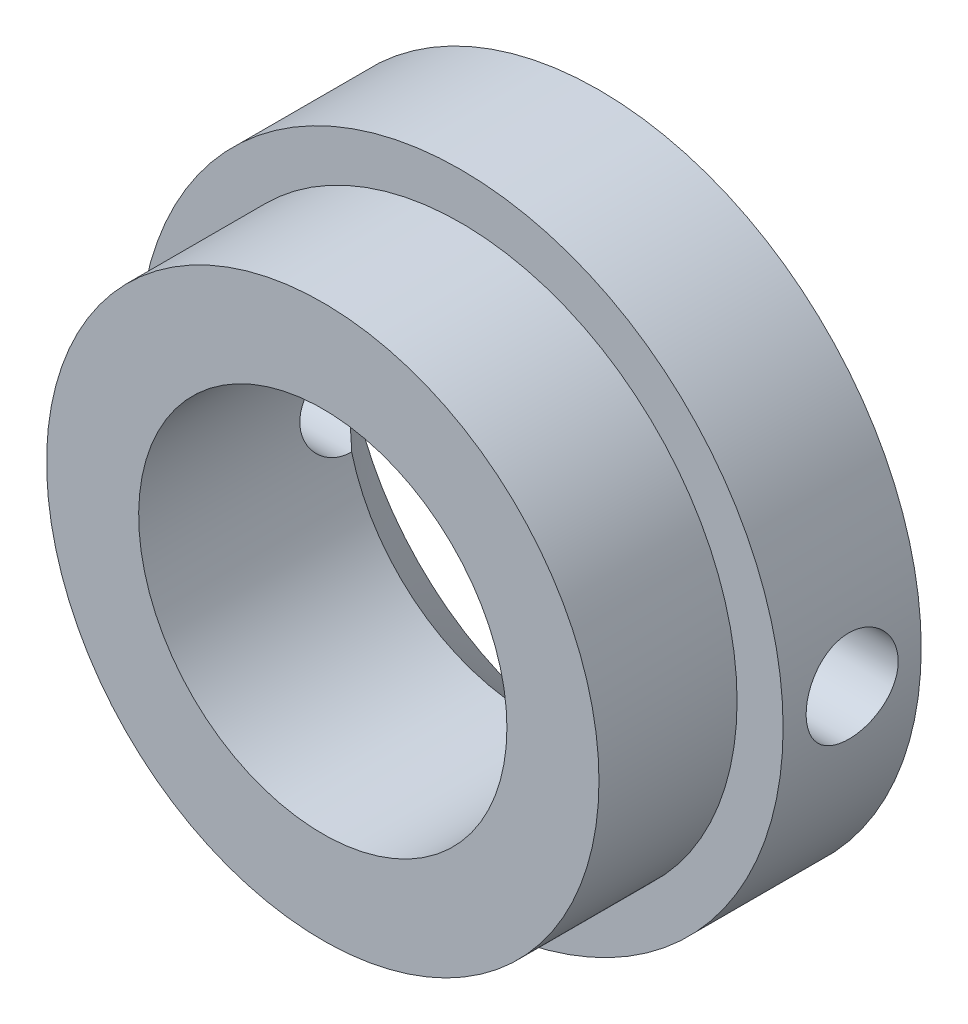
ISO-10303-21;
HEADER;
FILE_DESCRIPTION(('STEP AP214'),'2;1');
FILE_NAME('part.step','',(''),(''),'','','');
FILE_SCHEMA(('AUTOMOTIVE_DESIGN { 1 0 10303 214 1 1 1 1 }'));
ENDSEC;
DATA;
#1=APPLICATION_CONTEXT('core data for automotive mechanical design processes');
#2=APPLICATION_PROTOCOL_DEFINITION('international standard','automotive_design',2000,#1);
#3=PRODUCT_CONTEXT('',#1,'mechanical');
#4=PRODUCT('Part','Part','',(#3));
#5=PRODUCT_RELATED_PRODUCT_CATEGORY('part','',(#4));
#6=PRODUCT_DEFINITION_FORMATION('','',#4);
#7=PRODUCT_DEFINITION_CONTEXT('part definition',#1,'design');
#8=PRODUCT_DEFINITION('design','',#6,#7);
#9=PRODUCT_DEFINITION_SHAPE('','',#8);
#10=(LENGTH_UNIT() NAMED_UNIT(*) SI_UNIT(.MILLI.,.METRE.));
#11=(NAMED_UNIT(*) PLANE_ANGLE_UNIT() SI_UNIT($,.RADIAN.));
#12=(NAMED_UNIT(*) SI_UNIT($,.STERADIAN.) SOLID_ANGLE_UNIT());
#13=UNCERTAINTY_MEASURE_WITH_UNIT(LENGTH_MEASURE(1.E-05),#10,'distance_accuracy_value','');
#14=(GEOMETRIC_REPRESENTATION_CONTEXT(3) GLOBAL_UNCERTAINTY_ASSIGNED_CONTEXT((#13)) GLOBAL_UNIT_ASSIGNED_CONTEXT((#10,
#11,#12)) REPRESENTATION_CONTEXT('',''));
#15=CARTESIAN_POINT('',(0.,0.,0.));
#16=DIRECTION('',(0.,0.,1.));
#17=DIRECTION('',(1.,0.,0.));
#18=AXIS2_PLACEMENT_3D('',#15,#16,#17);
#19=CARTESIAN_POINT('',(0.,0.,0.));
#20=DIRECTION('',(0.,0.,1.));
#21=DIRECTION('',(1.,0.,0.));
#22=AXIS2_PLACEMENT_3D('',#19,#20,#21);
#23=PLANE('',#22);
#24=CARTESIAN_POINT('',(0.,0.,0.));
#25=DIRECTION('',(0.,0.,1.));
#26=DIRECTION('',(1.,0.,0.));
#27=AXIS2_PLACEMENT_3D('',#24,#25,#26);
#28=CIRCLE('',#27,7.);
#29=CARTESIAN_POINT('',(7.,0.,0.));
#30=VERTEX_POINT('',#29);
#31=EDGE_CURVE('E94',#30,#30,#28,.T.);
#32=ORIENTED_EDGE('',*,*,#31,.F.);
#33=EDGE_LOOP('',(#32));
#34=FACE_BOUND('',#33,.T.);
#35=CARTESIAN_POINT('',(0.,0.,0.));
#36=DIRECTION('',(0.,0.,-1.));
#37=DIRECTION('',(-1.,0.,0.));
#38=AXIS2_PLACEMENT_3D('',#35,#36,#37);
#39=CIRCLE('',#38,5.5);
#40=CARTESIAN_POINT('',(-5.5,0.,0.));
#41=VERTEX_POINT('',#40);
#42=EDGE_CURVE('E87',#41,#41,#39,.T.);
#43=ORIENTED_EDGE('',*,*,#42,.F.);
#44=EDGE_LOOP('',(#43));
#45=FACE_BOUND('',#44,.T.);
#46=ADVANCED_FACE('F34',(#34,#45),#23,.F.);
#47=CARTESIAN_POINT('',(0.,0.,3.));
#48=DIRECTION('',(0.,0.,-1.));
#49=DIRECTION('',(-1.,0.,0.));
#50=AXIS2_PLACEMENT_3D('',#47,#48,#49);
#51=CYLINDRICAL_SURFACE('',#50,7.);
#52=CARTESIAN_POINT('',(-7.,0.,0.500000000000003));
#53=CARTESIAN_POINT('',(-6.99999913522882,0.0558653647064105,0.500002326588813));
#54=CARTESIAN_POINT('',(-6.99932420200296,0.111763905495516,0.504697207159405));
#55=CARTESIAN_POINT('',(-6.99669670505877,0.22200066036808,0.523349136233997));
#56=CARTESIAN_POINT('',(-6.99474286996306,0.276337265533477,0.537315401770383));
#57=CARTESIAN_POINT('',(-6.98977730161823,0.381838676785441,0.574086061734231));
#58=CARTESIAN_POINT('',(-6.98676634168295,0.433005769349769,0.596883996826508));
#59=CARTESIAN_POINT('',(-6.98001989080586,0.530779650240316,0.650655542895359));
#60=CARTESIAN_POINT('',(-6.97628450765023,0.577387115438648,0.681627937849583));
#61=CARTESIAN_POINT('',(-6.96847539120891,0.66505865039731,0.751104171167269));
#62=CARTESIAN_POINT('',(-6.96439965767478,0.706085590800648,0.789654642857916));
#63=CARTESIAN_POINT('',(-6.95638499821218,0.781111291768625,0.873092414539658));
#64=CARTESIAN_POINT('',(-6.95244607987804,0.815109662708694,0.917980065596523));
#65=CARTESIAN_POINT('',(-6.94513156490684,0.875255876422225,1.01306511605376));
#66=CARTESIAN_POINT('',(-6.94175855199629,0.901368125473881,1.06328524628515));
#67=CARTESIAN_POINT('',(-6.93598482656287,0.944773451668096,1.16745453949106));
#68=CARTESIAN_POINT('',(-6.93358406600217,0.96206696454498,1.22140351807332));
#69=CARTESIAN_POINT('',(-6.93004619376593,0.987229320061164,1.33111000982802));
#70=CARTESIAN_POINT('',(-6.92890059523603,0.995161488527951,1.38685271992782));
#71=CARTESIAN_POINT('',(-6.92797693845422,1.00157210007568,1.4988889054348));
#72=CARTESIAN_POINT('',(-6.92819880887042,1.00005103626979,1.55518235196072));
#73=CARTESIAN_POINT('',(-6.9299772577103,0.987650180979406,1.66627654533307));
#74=CARTESIAN_POINT('',(-6.9315238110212,0.976840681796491,1.72108532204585));
#75=CARTESIAN_POINT('',(-6.93576171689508,0.946279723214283,1.82810308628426));
#76=CARTESIAN_POINT('',(-6.9384530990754,0.92652803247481,1.88031200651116));
#77=CARTESIAN_POINT('',(-6.94468857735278,0.878569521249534,1.98086327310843));
#78=CARTESIAN_POINT('',(-6.94823569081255,0.850332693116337,2.0291911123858));
#79=CARTESIAN_POINT('',(-6.95578073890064,0.786226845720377,2.1204492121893));
#80=CARTESIAN_POINT('',(-6.95977870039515,0.750357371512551,2.16337915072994));
#81=CARTESIAN_POINT('',(-6.9678193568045,0.671617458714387,2.24303040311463));
#82=CARTESIAN_POINT('',(-6.97186212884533,0.628686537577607,2.27969194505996));
#83=CARTESIAN_POINT('',(-6.97950317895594,0.537249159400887,2.34529850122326));
#84=CARTESIAN_POINT('',(-6.98310145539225,0.488742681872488,2.37424348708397));
#85=CARTESIAN_POINT('',(-6.98945135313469,0.387481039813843,2.42359743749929));
#86=CARTESIAN_POINT('',(-6.99220254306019,0.334723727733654,2.44400205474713));
#87=CARTESIAN_POINT('',(-6.99654459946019,0.226483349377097,2.47564546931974));
#88=CARTESIAN_POINT('',(-6.99813553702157,0.171000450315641,2.48688482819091));
#89=CARTESIAN_POINT('',(-6.99996847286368,0.0594000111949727,2.49979981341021));
#90=CARTESIAN_POINT('',(-7.00022206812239,0.00329216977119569,2.50155766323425));
#91=CARTESIAN_POINT('',(-6.9993832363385,-0.108417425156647,2.49567759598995));
#92=CARTESIAN_POINT('',(-6.99829084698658,-0.164019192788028,2.48803994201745));
#93=CARTESIAN_POINT('',(-6.99488996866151,-0.272891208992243,2.46365402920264));
#94=CARTESIAN_POINT('',(-6.99258679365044,-0.32617055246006,2.44694557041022));
#95=CARTESIAN_POINT('',(-6.98702187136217,-0.429171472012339,2.40493413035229));
#96=CARTESIAN_POINT('',(-6.98376008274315,-0.478892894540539,2.37963077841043));
#97=CARTESIAN_POINT('',(-6.97661188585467,-0.573729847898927,2.32095309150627));
#98=CARTESIAN_POINT('',(-6.97272147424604,-0.618812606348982,2.28752628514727));
#99=CARTESIAN_POINT('',(-6.96476223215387,-0.702757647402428,2.21362396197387));
#100=CARTESIAN_POINT('',(-6.96069339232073,-0.741619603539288,2.17314807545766));
#101=CARTESIAN_POINT('',(-6.95279940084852,-0.812316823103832,2.08593164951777));
#102=CARTESIAN_POINT('',(-6.94897630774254,-0.844097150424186,2.03914636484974));
#103=CARTESIAN_POINT('',(-6.94204235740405,-0.89934784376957,1.940853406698));
#104=CARTESIAN_POINT('',(-6.9389314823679,-0.922818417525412,1.88934585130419));
#105=CARTESIAN_POINT('',(-6.93378885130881,-0.960697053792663,1.78323834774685));
#106=CARTESIAN_POINT('',(-6.93175358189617,-0.975134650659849,1.72864912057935));
#107=CARTESIAN_POINT('',(-6.92898304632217,-0.994631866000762,1.6177897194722));
#108=CARTESIAN_POINT('',(-6.92824769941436,-0.999692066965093,1.56151965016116));
#109=CARTESIAN_POINT('',(-6.92816308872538,-1.00027795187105,1.44944308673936));
#110=CARTESIAN_POINT('',(-6.92880127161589,-0.995889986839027,1.39363703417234));
#111=CARTESIAN_POINT('',(-6.9313646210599,-0.977888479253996,1.28356493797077));
#112=CARTESIAN_POINT('',(-6.93328978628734,-0.96427494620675,1.22929889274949));
#113=CARTESIAN_POINT('',(-6.93820594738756,-0.928238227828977,1.12386736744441));
#114=CARTESIAN_POINT('',(-6.94119628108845,-0.905820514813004,1.07269998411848));
#115=CARTESIAN_POINT('',(-6.94790672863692,-0.852820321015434,0.974838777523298));
#116=CARTESIAN_POINT('',(-6.95162686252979,-0.822237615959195,0.928145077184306));
#117=CARTESIAN_POINT('',(-6.95941831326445,-0.753459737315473,0.840117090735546));
#118=CARTESIAN_POINT('',(-6.96349241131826,-0.715200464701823,0.798833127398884));
#119=CARTESIAN_POINT('',(-6.97150911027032,-0.632290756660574,0.723240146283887));
#120=CARTESIAN_POINT('',(-6.97545168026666,-0.587638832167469,0.688932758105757));
#121=CARTESIAN_POINT('',(-6.98278331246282,-0.492951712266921,0.62811621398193));
#122=CARTESIAN_POINT('',(-6.98616952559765,-0.442890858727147,0.601646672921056));
#123=CARTESIAN_POINT('',(-6.99197878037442,-0.339010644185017,0.557530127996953));
#124=CARTESIAN_POINT('',(-6.99440283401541,-0.28519530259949,0.53987384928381));
#125=CARTESIAN_POINT('',(-6.99745181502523,-0.192605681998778,0.517958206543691));
#126=CARTESIAN_POINT('',(-6.99840255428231,-0.154406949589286,0.511233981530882));
#127=CARTESIAN_POINT('',(-6.99967694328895,-0.0774774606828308,0.502254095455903));
#128=CARTESIAN_POINT('',(-7.00000059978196,-0.0387467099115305,0.499998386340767));
#129=CARTESIAN_POINT('',(-7.,0.,0.500000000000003));
#130=B_SPLINE_CURVE_WITH_KNOTS('',3,(#52,#53,#54,#55,#56,#57,#58,#59,#60,#61,#62,#63,#64,#65,
#66,#67,#68,#69,#70,#71,#72,#73,#74,#75,#76,#77,#78,#79,#80,#81,#82,#83,#84,#85,#86,#87,#88,#89,
#90,#91,#92,#93,#94,#95,#96,#97,#98,#99,#100,#101,#102,#103,#104,#105,#106,#107,#108,#109,#110,
#111,#112,#113,#114,#115,#116,#117,#118,#119,#120,#121,#122,#123,#124,#125,#126,#127,#128,#129),
.UNSPECIFIED.,.T.,.F.,(4,2,2,2,2,2,2,2,2,2,2,2,2,2,2,2,2,2,2,2,2,2,2,2,2,2,2,2,2,2,2,2,2,2,2,2,
2,2,4),(0.,0.167454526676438,0.335075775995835,0.50257466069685,0.670048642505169,
0.838587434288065,1.00713556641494,1.17643344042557,1.34572294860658,1.51386059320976,
1.68198946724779,1.8488570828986,2.01572901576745,2.18319817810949,2.35067732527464,
2.51967378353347,2.68867086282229,2.8577538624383,3.02682650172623,3.19443056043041,
3.36202992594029,3.52889978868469,3.69577684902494,3.86376187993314,4.03175572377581,
4.20101062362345,4.37026129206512,4.53895564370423,4.70763951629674,4.87478825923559,
5.04193682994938,5.2089816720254,5.37603110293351,5.54453823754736,5.71308468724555,
5.88246902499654,6.05167472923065,6.16781792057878,6.28395986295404),.UNSPECIFIED.);
#131=CARTESIAN_POINT('',(-7.,0.,0.500000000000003));
#132=VERTEX_POINT('',#131);
#133=EDGE_CURVE('E123',#132,#132,#130,.T.);
#134=ORIENTED_EDGE('',*,*,#133,.T.);
#135=EDGE_LOOP('',(#134));
#136=FACE_BOUND('',#135,.T.);
#137=CARTESIAN_POINT('',(7.,0.,0.500000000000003));
#138=CARTESIAN_POINT('',(6.99999913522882,-0.0558653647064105,0.500002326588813));
#139=CARTESIAN_POINT('',(6.99932420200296,-0.111763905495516,0.504697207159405));
#140=CARTESIAN_POINT('',(6.99669670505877,-0.22200066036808,0.523349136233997));
#141=CARTESIAN_POINT('',(6.99474286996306,-0.276337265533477,0.537315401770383));
#142=CARTESIAN_POINT('',(6.98977730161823,-0.381838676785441,0.574086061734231));
#143=CARTESIAN_POINT('',(6.98676634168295,-0.433005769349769,0.596883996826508));
#144=CARTESIAN_POINT('',(6.98001989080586,-0.530779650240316,0.650655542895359));
#145=CARTESIAN_POINT('',(6.97628450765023,-0.577387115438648,0.681627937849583));
#146=CARTESIAN_POINT('',(6.96847539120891,-0.66505865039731,0.751104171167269));
#147=CARTESIAN_POINT('',(6.96439965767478,-0.706085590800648,0.789654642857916));
#148=CARTESIAN_POINT('',(6.95638499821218,-0.781111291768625,0.873092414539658));
#149=CARTESIAN_POINT('',(6.95244607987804,-0.815109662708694,0.917980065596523));
#150=CARTESIAN_POINT('',(6.94513156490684,-0.875255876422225,1.01306511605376));
#151=CARTESIAN_POINT('',(6.94175855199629,-0.901368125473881,1.06328524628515));
#152=CARTESIAN_POINT('',(6.93598482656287,-0.944773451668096,1.16745453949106));
#153=CARTESIAN_POINT('',(6.93358406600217,-0.96206696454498,1.22140351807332));
#154=CARTESIAN_POINT('',(6.93004619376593,-0.987229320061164,1.33111000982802));
#155=CARTESIAN_POINT('',(6.92890059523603,-0.995161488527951,1.38685271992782));
#156=CARTESIAN_POINT('',(6.92797693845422,-1.00157210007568,1.4988889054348));
#157=CARTESIAN_POINT('',(6.92819880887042,-1.00005103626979,1.55518235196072));
#158=CARTESIAN_POINT('',(6.9299772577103,-0.987650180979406,1.66627654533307));
#159=CARTESIAN_POINT('',(6.9315238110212,-0.976840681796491,1.72108532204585));
#160=CARTESIAN_POINT('',(6.93576171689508,-0.946279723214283,1.82810308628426));
#161=CARTESIAN_POINT('',(6.9384530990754,-0.92652803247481,1.88031200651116));
#162=CARTESIAN_POINT('',(6.94468857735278,-0.878569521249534,1.98086327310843));
#163=CARTESIAN_POINT('',(6.94823569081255,-0.850332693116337,2.0291911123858));
#164=CARTESIAN_POINT('',(6.95578073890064,-0.786226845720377,2.1204492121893));
#165=CARTESIAN_POINT('',(6.95977870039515,-0.750357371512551,2.16337915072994));
#166=CARTESIAN_POINT('',(6.9678193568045,-0.671617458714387,2.24303040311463));
#167=CARTESIAN_POINT('',(6.97186212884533,-0.628686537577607,2.27969194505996));
#168=CARTESIAN_POINT('',(6.97950317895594,-0.537249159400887,2.34529850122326));
#169=CARTESIAN_POINT('',(6.98310145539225,-0.488742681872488,2.37424348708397));
#170=CARTESIAN_POINT('',(6.98945135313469,-0.387481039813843,2.42359743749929));
#171=CARTESIAN_POINT('',(6.99220254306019,-0.334723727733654,2.44400205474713));
#172=CARTESIAN_POINT('',(6.99654459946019,-0.226483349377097,2.47564546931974));
#173=CARTESIAN_POINT('',(6.99813553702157,-0.171000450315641,2.48688482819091));
#174=CARTESIAN_POINT('',(6.99996847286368,-0.0594000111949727,2.49979981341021));
#175=CARTESIAN_POINT('',(7.00022206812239,-0.00329216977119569,2.50155766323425));
#176=CARTESIAN_POINT('',(6.9993832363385,0.108417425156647,2.49567759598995));
#177=CARTESIAN_POINT('',(6.99829084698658,0.164019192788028,2.48803994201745));
#178=CARTESIAN_POINT('',(6.99488996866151,0.272891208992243,2.46365402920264));
#179=CARTESIAN_POINT('',(6.99258679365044,0.32617055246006,2.44694557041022));
#180=CARTESIAN_POINT('',(6.98702187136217,0.429171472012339,2.40493413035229));
#181=CARTESIAN_POINT('',(6.98376008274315,0.478892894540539,2.37963077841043));
#182=CARTESIAN_POINT('',(6.97661188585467,0.573729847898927,2.32095309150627));
#183=CARTESIAN_POINT('',(6.97272147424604,0.618812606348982,2.28752628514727));
#184=CARTESIAN_POINT('',(6.96476223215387,0.702757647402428,2.21362396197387));
#185=CARTESIAN_POINT('',(6.96069339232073,0.741619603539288,2.17314807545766));
#186=CARTESIAN_POINT('',(6.95279940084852,0.812316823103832,2.08593164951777));
#187=CARTESIAN_POINT('',(6.94897630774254,0.844097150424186,2.03914636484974));
#188=CARTESIAN_POINT('',(6.94204235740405,0.89934784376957,1.940853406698));
#189=CARTESIAN_POINT('',(6.9389314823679,0.922818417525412,1.88934585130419));
#190=CARTESIAN_POINT('',(6.93378885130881,0.960697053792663,1.78323834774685));
#191=CARTESIAN_POINT('',(6.93175358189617,0.975134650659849,1.72864912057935));
#192=CARTESIAN_POINT('',(6.92898304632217,0.994631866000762,1.6177897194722));
#193=CARTESIAN_POINT('',(6.92824769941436,0.999692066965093,1.56151965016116));
#194=CARTESIAN_POINT('',(6.92816308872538,1.00027795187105,1.44944308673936));
#195=CARTESIAN_POINT('',(6.92880127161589,0.995889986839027,1.39363703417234));
#196=CARTESIAN_POINT('',(6.9313646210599,0.977888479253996,1.28356493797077));
#197=CARTESIAN_POINT('',(6.93328978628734,0.96427494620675,1.22929889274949));
#198=CARTESIAN_POINT('',(6.93820594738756,0.928238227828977,1.12386736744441));
#199=CARTESIAN_POINT('',(6.94119628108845,0.905820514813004,1.07269998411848));
#200=CARTESIAN_POINT('',(6.94790672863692,0.852820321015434,0.974838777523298));
#201=CARTESIAN_POINT('',(6.95162686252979,0.822237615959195,0.928145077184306));
#202=CARTESIAN_POINT('',(6.95941831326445,0.753459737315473,0.840117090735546));
#203=CARTESIAN_POINT('',(6.96349241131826,0.715200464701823,0.798833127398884));
#204=CARTESIAN_POINT('',(6.97150911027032,0.632290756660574,0.723240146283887));
#205=CARTESIAN_POINT('',(6.97545168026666,0.587638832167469,0.688932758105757));
#206=CARTESIAN_POINT('',(6.98278331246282,0.492951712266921,0.62811621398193));
#207=CARTESIAN_POINT('',(6.98616952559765,0.442890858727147,0.601646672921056));
#208=CARTESIAN_POINT('',(6.99197878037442,0.339010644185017,0.557530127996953));
#209=CARTESIAN_POINT('',(6.99440283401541,0.28519530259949,0.53987384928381));
#210=CARTESIAN_POINT('',(6.99745181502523,0.192605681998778,0.517958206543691));
#211=CARTESIAN_POINT('',(6.99840255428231,0.154406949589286,0.511233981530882));
#212=CARTESIAN_POINT('',(6.99967694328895,0.0774774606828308,0.502254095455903));
#213=CARTESIAN_POINT('',(7.00000059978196,0.0387467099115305,0.499998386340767));
#214=CARTESIAN_POINT('',(7.,0.,0.500000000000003));
#215=B_SPLINE_CURVE_WITH_KNOTS('',3,(#137,#138,#139,#140,#141,#142,#143,#144,#145,#146,#147,
#148,#149,#150,#151,#152,#153,#154,#155,#156,#157,#158,#159,#160,#161,#162,#163,#164,#165,#166,
#167,#168,#169,#170,#171,#172,#173,#174,#175,#176,#177,#178,#179,#180,#181,#182,#183,#184,#185,
#186,#187,#188,#189,#190,#191,#192,#193,#194,#195,#196,#197,#198,#199,#200,#201,#202,#203,#204,
#205,#206,#207,#208,#209,#210,#211,#212,#213,#214),.UNSPECIFIED.,.T.,.F.,(4,2,2,2,2,2,2,2,2,2,2,
2,2,2,2,2,2,2,2,2,2,2,2,2,2,2,2,2,2,2,2,2,2,2,2,2,2,2,4),(0.,0.167454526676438,
0.335075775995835,0.50257466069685,0.670048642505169,0.838587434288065,1.00713556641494,
1.17643344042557,1.34572294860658,1.51386059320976,1.68198946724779,1.8488570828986,
2.01572901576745,2.18319817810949,2.35067732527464,2.51967378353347,2.68867086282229,
2.8577538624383,3.02682650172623,3.19443056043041,3.36202992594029,3.52889978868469,
3.69577684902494,3.86376187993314,4.03175572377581,4.20101062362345,4.37026129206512,
4.53895564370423,4.70763951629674,4.87478825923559,5.04193682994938,5.2089816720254,
5.37603110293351,5.54453823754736,5.71308468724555,5.88246902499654,6.05167472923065,
6.16781792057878,6.28395986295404),.UNSPECIFIED.);
#216=CARTESIAN_POINT('',(7.,0.,0.500000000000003));
#217=VERTEX_POINT('',#216);
#218=EDGE_CURVE('E78',#217,#217,#215,.T.);
#219=ORIENTED_EDGE('',*,*,#218,.T.);
#220=EDGE_LOOP('',(#219));
#221=FACE_BOUND('',#220,.T.);
#222=CARTESIAN_POINT('',(0.,0.,3.));
#223=DIRECTION('',(0.,0.,1.));
#224=DIRECTION('',(1.,0.,0.));
#225=AXIS2_PLACEMENT_3D('',#222,#223,#224);
#226=CIRCLE('',#225,7.);
#227=CARTESIAN_POINT('',(7.,0.,3.));
#228=VERTEX_POINT('',#227);
#229=EDGE_CURVE('E71',#228,#228,#226,.T.);
#230=ORIENTED_EDGE('',*,*,#229,.F.);
#231=EDGE_LOOP('',(#230));
#232=FACE_BOUND('',#231,.T.);
#233=ORIENTED_EDGE('',*,*,#31,.T.);
#234=EDGE_LOOP('',(#233));
#235=FACE_BOUND('',#234,.T.);
#236=ADVANCED_FACE('F36',(#136,#221,#232,#235),#51,.T.);
#237=CARTESIAN_POINT('',(0.,0.,3.));
#238=DIRECTION('',(0.,0.,1.));
#239=DIRECTION('',(1.,0.,0.));
#240=AXIS2_PLACEMENT_3D('',#237,#238,#239);
#241=PLANE('',#240);
#242=CARTESIAN_POINT('',(0.,0.,3.));
#243=DIRECTION('',(0.,0.,1.));
#244=DIRECTION('',(1.,0.,0.));
#245=AXIS2_PLACEMENT_3D('',#242,#243,#244);
#246=CIRCLE('',#245,6.);
#247=CARTESIAN_POINT('',(6.,0.,3.));
#248=VERTEX_POINT('',#247);
#249=EDGE_CURVE('E85',#248,#248,#246,.T.);
#250=ORIENTED_EDGE('',*,*,#249,.F.);
#251=EDGE_LOOP('',(#250));
#252=FACE_BOUND('',#251,.T.);
#253=ORIENTED_EDGE('',*,*,#229,.T.);
#254=EDGE_LOOP('',(#253));
#255=FACE_BOUND('',#254,.T.);
#256=ADVANCED_FACE('F137',(#252,#255),#241,.T.);
#257=CARTESIAN_POINT('',(0.,0.,6.));
#258=DIRECTION('',(0.,0.,-1.));
#259=DIRECTION('',(-1.,0.,0.));
#260=AXIS2_PLACEMENT_3D('',#257,#258,#259);
#261=CYLINDRICAL_SURFACE('',#260,6.);
#262=CARTESIAN_POINT('',(0.,0.,6.));
#263=DIRECTION('',(0.,0.,1.));
#264=DIRECTION('',(1.,0.,0.));
#265=AXIS2_PLACEMENT_3D('',#262,#263,#264);
#266=CIRCLE('',#265,6.);
#267=CARTESIAN_POINT('',(6.,0.,6.));
#268=VERTEX_POINT('',#267);
#269=EDGE_CURVE('E91',#268,#268,#266,.T.);
#270=ORIENTED_EDGE('',*,*,#269,.F.);
#271=EDGE_LOOP('',(#270));
#272=FACE_BOUND('',#271,.T.);
#273=ORIENTED_EDGE('',*,*,#249,.T.);
#274=EDGE_LOOP('',(#273));
#275=FACE_BOUND('',#274,.T.);
#276=ADVANCED_FACE('F133',(#272,#275),#261,.T.);
#277=CARTESIAN_POINT('',(0.,0.,6.));
#278=DIRECTION('',(0.,0.,1.));
#279=DIRECTION('',(1.,0.,0.));
#280=AXIS2_PLACEMENT_3D('',#277,#278,#279);
#281=PLANE('',#280);
#282=CARTESIAN_POINT('',(0.,0.,6.));
#283=DIRECTION('',(0.,0.,1.));
#284=DIRECTION('',(1.,0.,0.));
#285=AXIS2_PLACEMENT_3D('',#282,#283,#284);
#286=CIRCLE('',#285,4.);
#287=CARTESIAN_POINT('',(4.,0.,6.));
#288=VERTEX_POINT('',#287);
#289=EDGE_CURVE('E82',#288,#288,#286,.T.);
#290=ORIENTED_EDGE('',*,*,#289,.F.);
#291=EDGE_LOOP('',(#290));
#292=FACE_BOUND('',#291,.T.);
#293=ORIENTED_EDGE('',*,*,#269,.T.);
#294=EDGE_LOOP('',(#293));
#295=FACE_BOUND('',#294,.T.);
#296=ADVANCED_FACE('F129',(#292,#295),#281,.T.);
#297=CARTESIAN_POINT('',(0.,0.,0.));
#298=DIRECTION('',(0.,0.,-1.));
#299=DIRECTION('',(-1.,0.,0.));
#300=AXIS2_PLACEMENT_3D('',#297,#298,#299);
#301=CYLINDRICAL_SURFACE('',#300,4.);
#302=CARTESIAN_POINT('',(0.,0.,1.5));
#303=DIRECTION('',(0.,0.,-1.));
#304=DIRECTION('',(-1.,0.,0.));
#305=AXIS2_PLACEMENT_3D('',#302,#303,#304);
#306=CIRCLE('',#305,4.);
#307=CARTESIAN_POINT('',(-3.87298334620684,1.00000000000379,1.49999999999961));
#308=VERTEX_POINT('',#307);
#309=CARTESIAN_POINT('',(3.87298334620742,0.999999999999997,1.5));
#310=VERTEX_POINT('',#309);
#311=EDGE_CURVE('E76',#308,#310,#306,.T.);
#312=ORIENTED_EDGE('',*,*,#311,.T.);
#313=CARTESIAN_POINT('',(3.87298334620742,0.999999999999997,1.5));
#314=CARTESIAN_POINT('',(3.87298148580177,1.00000033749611,1.52766298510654));
#315=CARTESIAN_POINT('',(3.87328009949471,0.998851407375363,1.55531226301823));
#316=CARTESIAN_POINT('',(3.87445904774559,0.994271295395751,1.61040403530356));
#317=CARTESIAN_POINT('',(3.87533928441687,0.990840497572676,1.63784656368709));
#318=CARTESIAN_POINT('',(3.87881710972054,0.977175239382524,1.71945317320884));
#319=CARTESIAN_POINT('',(3.88225203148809,0.96356769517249,1.77305646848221));
#320=CARTESIAN_POINT('',(3.89095422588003,0.927798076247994,1.87712467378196));
#321=CARTESIAN_POINT('',(3.8962213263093,0.905636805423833,1.92758987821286));
#322=CARTESIAN_POINT('',(3.90799134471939,0.853415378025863,2.02411144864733));
#323=CARTESIAN_POINT('',(3.91449459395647,0.82335310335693,2.07016662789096));
#324=CARTESIAN_POINT('',(3.92816262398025,0.755484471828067,2.1575438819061));
#325=CARTESIAN_POINT('',(3.93533791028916,0.717537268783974,2.19875488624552));
#326=CARTESIAN_POINT('',(3.94945104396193,0.635275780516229,2.27430208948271));
#327=CARTESIAN_POINT('',(3.95638885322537,0.59096047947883,2.30863718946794));
#328=CARTESIAN_POINT('',(3.96936182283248,0.49645689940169,2.36991100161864));
#329=CARTESIAN_POINT('',(3.9753830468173,0.446195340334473,2.39673989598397));
#330=CARTESIAN_POINT('',(3.98572346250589,0.341702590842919,2.4415247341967));
#331=CARTESIAN_POINT('',(3.99004298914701,0.28747218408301,2.45948242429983));
#332=CARTESIAN_POINT('',(3.99641900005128,0.177744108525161,2.48565899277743));
#333=CARTESIAN_POINT('',(3.99851952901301,0.122294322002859,2.49406767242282));
#334=CARTESIAN_POINT('',(4.00037438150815,0.0107327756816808,2.50150337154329));
#335=CARTESIAN_POINT('',(4.00012899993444,-0.0453789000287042,2.50053157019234));
#336=CARTESIAN_POINT('',(3.99735237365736,-0.155352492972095,2.48937003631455));
#337=CARTESIAN_POINT('',(3.99487198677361,-0.209236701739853,2.47938538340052));
#338=CARTESIAN_POINT('',(3.98796330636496,-0.314538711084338,2.45081132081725));
#339=CARTESIAN_POINT('',(3.98353492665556,-0.365956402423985,2.43222153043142));
#340=CARTESIAN_POINT('',(3.97314997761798,-0.465407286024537,2.38679871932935));
#341=CARTESIAN_POINT('',(3.96717993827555,-0.513405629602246,2.35989260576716));
#342=CARTESIAN_POINT('',(3.95435945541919,-0.604276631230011,2.29865687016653));
#343=CARTESIAN_POINT('',(3.94750887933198,-0.647148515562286,2.26432612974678));
#344=CARTESIAN_POINT('',(3.93345566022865,-0.727769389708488,2.18812108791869));
#345=CARTESIAN_POINT('',(3.92624850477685,-0.765349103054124,2.14606836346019));
#346=CARTESIAN_POINT('',(3.91246168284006,-0.832969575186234,2.05617013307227));
#347=CARTESIAN_POINT('',(3.90588218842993,-0.863008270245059,2.00832304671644));
#348=CARTESIAN_POINT('',(3.89407813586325,-0.914804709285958,1.90785440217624));
#349=CARTESIAN_POINT('',(3.88886106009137,-0.936517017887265,1.85520853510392));
#350=CARTESIAN_POINT('',(3.88047058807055,-0.970702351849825,1.74688307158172));
#351=CARTESIAN_POINT('',(3.87729413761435,-0.983189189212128,1.69120814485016));
#352=CARTESIAN_POINT('',(3.87455290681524,-0.993904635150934,1.6125426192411));
#353=CARTESIAN_POINT('',(3.8739652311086,-0.996190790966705,1.59008029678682));
#354=CARTESIAN_POINT('',(3.87318062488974,-0.99923675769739,1.54508221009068));
#355=CARTESIAN_POINT('',(3.87298306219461,-0.999999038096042,1.52254662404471));
#356=CARTESIAN_POINT('',(3.87298334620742,-0.999999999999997,1.5));
#357=B_SPLINE_CURVE_WITH_KNOTS('',3,(#313,#314,#315,#316,#317,#318,#319,#320,#321,#322,#323,
#324,#325,#326,#327,#328,#329,#330,#331,#332,#333,#334,#335,#336,#337,#338,#339,#340,#341,#342,
#343,#344,#345,#346,#347,#348,#349,#350,#351,#352,#353,#354,#355,#356),.UNSPECIFIED.,.F.,.F.,(4,
2,2,2,2,2,2,2,2,2,2,2,2,2,2,2,2,2,2,2,2,4),(0.,0.0829365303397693,0.165859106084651,
0.331229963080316,0.496585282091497,0.661984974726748,0.830641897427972,0.99932575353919,
1.17036187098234,1.34136430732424,1.50890481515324,1.67642426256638,1.84022545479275,
2.00403389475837,2.16932509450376,2.33464120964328,2.50441429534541,2.67423379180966,
2.84496720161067,3.01544447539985,3.08315848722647,3.15076267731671),.UNSPECIFIED.);
#358=CARTESIAN_POINT('',(3.87298334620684,-1.00000000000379,1.49999999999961));
#359=VERTEX_POINT('',#358);
#360=EDGE_CURVE('E61',#310,#359,#357,.T.);
#361=ORIENTED_EDGE('',*,*,#360,.T.);
#362=CARTESIAN_POINT('',(-3.87298334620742,-0.999999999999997,1.5));
#363=VERTEX_POINT('',#362);
#364=EDGE_CURVE('E77',#359,#363,#306,.T.);
#365=ORIENTED_EDGE('',*,*,#364,.T.);
#366=CARTESIAN_POINT('',(-3.87298334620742,-0.999999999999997,1.5));
#367=CARTESIAN_POINT('',(-3.87298148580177,-1.00000033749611,1.52766298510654));
#368=CARTESIAN_POINT('',(-3.87328009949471,-0.998851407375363,1.55531226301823));
#369=CARTESIAN_POINT('',(-3.87445904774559,-0.994271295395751,1.61040403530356));
#370=CARTESIAN_POINT('',(-3.87533928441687,-0.990840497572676,1.63784656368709));
#371=CARTESIAN_POINT('',(-3.87881710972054,-0.977175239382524,1.71945317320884));
#372=CARTESIAN_POINT('',(-3.88225203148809,-0.96356769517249,1.77305646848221));
#373=CARTESIAN_POINT('',(-3.89095422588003,-0.927798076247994,1.87712467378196));
#374=CARTESIAN_POINT('',(-3.8962213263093,-0.905636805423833,1.92758987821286));
#375=CARTESIAN_POINT('',(-3.90799134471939,-0.853415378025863,2.02411144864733));
#376=CARTESIAN_POINT('',(-3.91449459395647,-0.82335310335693,2.07016662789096));
#377=CARTESIAN_POINT('',(-3.92816262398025,-0.755484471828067,2.1575438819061));
#378=CARTESIAN_POINT('',(-3.93533791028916,-0.717537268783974,2.19875488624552));
#379=CARTESIAN_POINT('',(-3.94945104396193,-0.635275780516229,2.27430208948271));
#380=CARTESIAN_POINT('',(-3.95638885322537,-0.59096047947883,2.30863718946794));
#381=CARTESIAN_POINT('',(-3.96936182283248,-0.49645689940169,2.36991100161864));
#382=CARTESIAN_POINT('',(-3.9753830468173,-0.446195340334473,2.39673989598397));
#383=CARTESIAN_POINT('',(-3.98572346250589,-0.341702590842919,2.4415247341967));
#384=CARTESIAN_POINT('',(-3.99004298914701,-0.28747218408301,2.45948242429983));
#385=CARTESIAN_POINT('',(-3.99641900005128,-0.177744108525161,2.48565899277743));
#386=CARTESIAN_POINT('',(-3.99851952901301,-0.122294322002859,2.49406767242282));
#387=CARTESIAN_POINT('',(-4.00037438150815,-0.0107327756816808,2.50150337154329));
#388=CARTESIAN_POINT('',(-4.00012899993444,0.0453789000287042,2.50053157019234));
#389=CARTESIAN_POINT('',(-3.99735237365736,0.155352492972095,2.48937003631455));
#390=CARTESIAN_POINT('',(-3.99487198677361,0.209236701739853,2.47938538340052));
#391=CARTESIAN_POINT('',(-3.98796330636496,0.314538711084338,2.45081132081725));
#392=CARTESIAN_POINT('',(-3.98353492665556,0.365956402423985,2.43222153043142));
#393=CARTESIAN_POINT('',(-3.97314997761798,0.465407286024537,2.38679871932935));
#394=CARTESIAN_POINT('',(-3.96717993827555,0.513405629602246,2.35989260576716));
#395=CARTESIAN_POINT('',(-3.95435945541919,0.604276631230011,2.29865687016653));
#396=CARTESIAN_POINT('',(-3.94750887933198,0.647148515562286,2.26432612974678));
#397=CARTESIAN_POINT('',(-3.93345566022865,0.727769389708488,2.18812108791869));
#398=CARTESIAN_POINT('',(-3.92624850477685,0.765349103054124,2.14606836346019));
#399=CARTESIAN_POINT('',(-3.91246168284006,0.832969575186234,2.05617013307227));
#400=CARTESIAN_POINT('',(-3.90588218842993,0.863008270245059,2.00832304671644));
#401=CARTESIAN_POINT('',(-3.89407813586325,0.914804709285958,1.90785440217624));
#402=CARTESIAN_POINT('',(-3.88886106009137,0.936517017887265,1.85520853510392));
#403=CARTESIAN_POINT('',(-3.88047058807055,0.970702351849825,1.74688307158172));
#404=CARTESIAN_POINT('',(-3.87729413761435,0.983189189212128,1.69120814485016));
#405=CARTESIAN_POINT('',(-3.87455290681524,0.993904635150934,1.6125426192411));
#406=CARTESIAN_POINT('',(-3.8739652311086,0.996190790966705,1.59008029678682));
#407=CARTESIAN_POINT('',(-3.87318062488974,0.99923675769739,1.54508221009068));
#408=CARTESIAN_POINT('',(-3.87298306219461,0.999999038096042,1.52254662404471));
#409=CARTESIAN_POINT('',(-3.87298334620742,0.999999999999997,1.5));
#410=B_SPLINE_CURVE_WITH_KNOTS('',3,(#366,#367,#368,#369,#370,#371,#372,#373,#374,#375,#376,
#377,#378,#379,#380,#381,#382,#383,#384,#385,#386,#387,#388,#389,#390,#391,#392,#393,#394,#395,
#396,#397,#398,#399,#400,#401,#402,#403,#404,#405,#406,#407,#408,#409),.UNSPECIFIED.,.F.,.F.,(4,
2,2,2,2,2,2,2,2,2,2,2,2,2,2,2,2,2,2,2,2,4),(0.,0.0829365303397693,0.165859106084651,
0.331229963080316,0.496585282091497,0.661984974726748,0.830641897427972,0.99932575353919,
1.17036187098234,1.34136430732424,1.50890481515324,1.67642426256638,1.84022545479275,
2.00403389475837,2.16932509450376,2.33464120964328,2.50441429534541,2.67423379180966,
2.84496720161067,3.01544447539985,3.08315848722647,3.15076267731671),.UNSPECIFIED.);
#411=EDGE_CURVE('E54',#363,#308,#410,.T.);
#412=ORIENTED_EDGE('',*,*,#411,.T.);
#413=EDGE_LOOP('',(#312,#361,#365,#412));
#414=FACE_BOUND('',#413,.T.);
#415=ORIENTED_EDGE('',*,*,#289,.T.);
#416=EDGE_LOOP('',(#415));
#417=FACE_BOUND('',#416,.T.);
#418=ADVANCED_FACE('F74',(#414,#417),#301,.F.);
#419=CARTESIAN_POINT('',(0.,0.,0.));
#420=DIRECTION('',(0.,0.,-1.));
#421=DIRECTION('',(-1.,0.,0.));
#422=AXIS2_PLACEMENT_3D('',#419,#420,#421);
#423=CONICAL_SURFACE('',#422,5.5,0.785398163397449);
#424=ORIENTED_EDGE('',*,*,#364,.F.);
#425=CARTESIAN_POINT('',(3.77073999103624,-0.994967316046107,1.6002));
#426=CARTESIAN_POINT('',(3.81165198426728,-0.999035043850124,1.55959874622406));
#427=CARTESIAN_POINT('',(3.85299589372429,-1.0006134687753,1.51920976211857));
#428=CARTESIAN_POINT('',(3.93619533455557,-0.998950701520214,1.43903938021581));
#429=CARTESIAN_POINT('',(3.97805098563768,-0.995708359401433,1.39925812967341));
#430=CARTESIAN_POINT('',(4.0622818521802,-0.984510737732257,1.32014890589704));
#431=CARTESIAN_POINT('',(4.10465833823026,-0.976513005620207,1.28082830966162));
#432=CARTESIAN_POINT('',(4.18917411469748,-0.95578947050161,1.20321903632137));
#433=CARTESIAN_POINT('',(4.23131345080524,-0.943064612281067,1.16493015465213));
#434=CARTESIAN_POINT('',(4.33989894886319,-0.903796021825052,1.06715274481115));
#435=CARTESIAN_POINT('',(4.40589265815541,-0.873534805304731,1.00860247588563));
#436=CARTESIAN_POINT('',(4.5341482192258,-0.799874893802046,0.896089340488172));
#437=CARTESIAN_POINT('',(4.59642210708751,-0.756521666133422,0.842111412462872));
#438=CARTESIAN_POINT('',(4.69254600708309,-0.673587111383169,0.759502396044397));
#439=CARTESIAN_POINT('',(4.72845530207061,-0.638435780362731,0.72882659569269));
#440=CARTESIAN_POINT('',(4.79617907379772,-0.561643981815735,0.671233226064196));
#441=CARTESIAN_POINT('',(4.82799879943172,-0.520011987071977,0.644310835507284));
#442=CARTESIAN_POINT('',(4.87890651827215,-0.440487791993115,0.601385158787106));
#443=CARTESIAN_POINT('',(4.89923379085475,-0.403982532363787,0.584299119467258));
#444=CARTESIAN_POINT('',(4.93518537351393,-0.327173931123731,0.554139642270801));
#445=CARTESIAN_POINT('',(4.95081607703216,-0.286875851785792,0.541060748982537));
#446=CARTESIAN_POINT('',(4.97401544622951,-0.210162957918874,0.521672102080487));
#447=CARTESIAN_POINT('',(4.98249337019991,-0.174219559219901,0.514597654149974));
#448=CARTESIAN_POINT('',(4.99468708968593,-0.100984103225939,0.504427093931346));
#449=CARTESIAN_POINT('',(4.99840615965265,-0.0636929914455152,0.501328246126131));
#450=CARTESIAN_POINT('',(5.00076844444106,0.0112440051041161,0.499359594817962));
#451=CARTESIAN_POINT('',(4.99940092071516,0.0488904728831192,0.500498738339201));
#452=CARTESIAN_POINT('',(4.9916884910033,0.123306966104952,0.506928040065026));
#453=CARTESIAN_POINT('',(4.98534167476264,0.160076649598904,0.512219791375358));
#454=CARTESIAN_POINT('',(4.9683762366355,0.230977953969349,0.52638354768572));
#455=CARTESIAN_POINT('',(4.95785502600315,0.265149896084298,0.535173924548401));
#456=CARTESIAN_POINT('',(4.93321428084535,0.331178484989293,0.555796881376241));
#457=CARTESIAN_POINT('',(4.91909318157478,0.363034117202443,0.567630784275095));
#458=CARTESIAN_POINT('',(4.87935380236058,0.440982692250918,0.601006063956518));
#459=CARTESIAN_POINT('',(4.85168235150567,0.485276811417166,0.624307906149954));
#460=CARTESIAN_POINT('',(4.79144311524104,0.567589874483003,0.675259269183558));
#461=CARTESIAN_POINT('',(4.75886296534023,0.605592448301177,0.702919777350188));
#462=CARTESIAN_POINT('',(4.6735257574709,0.692896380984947,0.775754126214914));
#463=CARTESIAN_POINT('',(4.6187200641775,0.738575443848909,0.822855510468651));
#464=CARTESIAN_POINT('',(4.50490780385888,0.818253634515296,0.92164329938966));
#465=CARTESIAN_POINT('',(4.44589108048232,0.852223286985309,0.973340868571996));
#466=CARTESIAN_POINT('',(4.30425433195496,0.919713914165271,1.09891580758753));
#467=CARTESIAN_POINT('',(4.22070608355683,0.948776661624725,1.17414120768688));
#468=CARTESIAN_POINT('',(4.05302507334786,0.988364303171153,1.32838020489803));
#469=CARTESIAN_POINT('',(3.96889382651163,0.998926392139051,1.40738587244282));
#470=CARTESIAN_POINT('',(3.86655786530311,1.00015405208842,1.50618535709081));
#471=CARTESIAN_POINT('',(3.84726801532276,0.999865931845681,1.52492923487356));
#472=CARTESIAN_POINT('',(3.80886883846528,0.998222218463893,1.56249926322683));
#473=CARTESIAN_POINT('',(3.78975929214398,0.996868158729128,1.58132525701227));
#474=CARTESIAN_POINT('',(3.77073999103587,0.994967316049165,1.60019999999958));
#475=B_SPLINE_CURVE_WITH_KNOTS('',3,(#425,#426,#427,#428,#429,#430,#431,#432,#433,#434,#435,
#436,#437,#438,#439,#440,#441,#442,#443,#444,#445,#446,#447,#448,#449,#450,#451,#452,#453,#454,
#455,#456,#457,#458,#459,#460,#461,#462,#463,#464,#465,#466,#467,#468,#469,#470,#471,#472,#473,
#474),.UNSPECIFIED.,.F.,.F.,(4,2,2,2,2,2,2,2,2,2,2,2,2,2,2,2,2,2,2,2,2,2,2,2,4),(0.,
0.173263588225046,0.346568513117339,0.521444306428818,0.6962851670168,0.975133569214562,
1.25302448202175,1.42917665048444,1.60510042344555,1.74005470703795,1.87482443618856,
1.98714333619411,2.09938491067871,2.21186357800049,2.32438541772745,2.43442288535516,
2.54450826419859,2.71510362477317,2.88613611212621,3.14120008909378,3.39690151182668,
3.74356328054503,4.08952729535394,4.17020801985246,4.2507728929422),.UNSPECIFIED.);
#476=EDGE_CURVE('E11',#359,#310,#475,.T.);
#477=ORIENTED_EDGE('',*,*,#476,.T.);
#478=ORIENTED_EDGE('',*,*,#311,.F.);
#479=CARTESIAN_POINT('',(-3.77073999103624,0.994967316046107,1.6002));
#480=CARTESIAN_POINT('',(-3.81165198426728,0.999035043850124,1.55959874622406));
#481=CARTESIAN_POINT('',(-3.85299589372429,1.0006134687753,1.51920976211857));
#482=CARTESIAN_POINT('',(-3.93619533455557,0.998950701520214,1.43903938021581));
#483=CARTESIAN_POINT('',(-3.97805098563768,0.995708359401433,1.39925812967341));
#484=CARTESIAN_POINT('',(-4.0622818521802,0.984510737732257,1.32014890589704));
#485=CARTESIAN_POINT('',(-4.10465833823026,0.976513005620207,1.28082830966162));
#486=CARTESIAN_POINT('',(-4.18917411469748,0.95578947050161,1.20321903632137));
#487=CARTESIAN_POINT('',(-4.23131345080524,0.943064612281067,1.16493015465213));
#488=CARTESIAN_POINT('',(-4.33989894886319,0.903796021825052,1.06715274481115));
#489=CARTESIAN_POINT('',(-4.40589265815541,0.873534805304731,1.00860247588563));
#490=CARTESIAN_POINT('',(-4.5341482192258,0.799874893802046,0.896089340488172));
#491=CARTESIAN_POINT('',(-4.59642210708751,0.756521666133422,0.842111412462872));
#492=CARTESIAN_POINT('',(-4.69254600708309,0.673587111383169,0.759502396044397));
#493=CARTESIAN_POINT('',(-4.72845530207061,0.638435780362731,0.72882659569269));
#494=CARTESIAN_POINT('',(-4.79617907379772,0.561643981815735,0.671233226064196));
#495=CARTESIAN_POINT('',(-4.82799879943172,0.520011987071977,0.644310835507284));
#496=CARTESIAN_POINT('',(-4.87890651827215,0.440487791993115,0.601385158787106));
#497=CARTESIAN_POINT('',(-4.89923379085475,0.403982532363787,0.584299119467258));
#498=CARTESIAN_POINT('',(-4.93518537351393,0.327173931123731,0.554139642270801));
#499=CARTESIAN_POINT('',(-4.95081607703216,0.286875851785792,0.541060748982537));
#500=CARTESIAN_POINT('',(-4.97401544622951,0.210162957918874,0.521672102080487));
#501=CARTESIAN_POINT('',(-4.98249337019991,0.174219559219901,0.514597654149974));
#502=CARTESIAN_POINT('',(-4.99468708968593,0.100984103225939,0.504427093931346));
#503=CARTESIAN_POINT('',(-4.99840615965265,0.0636929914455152,0.501328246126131));
#504=CARTESIAN_POINT('',(-5.00076844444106,-0.0112440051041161,0.499359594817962));
#505=CARTESIAN_POINT('',(-4.99940092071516,-0.0488904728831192,0.500498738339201));
#506=CARTESIAN_POINT('',(-4.9916884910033,-0.123306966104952,0.506928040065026));
#507=CARTESIAN_POINT('',(-4.98534167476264,-0.160076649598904,0.512219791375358));
#508=CARTESIAN_POINT('',(-4.9683762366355,-0.230977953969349,0.52638354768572));
#509=CARTESIAN_POINT('',(-4.95785502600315,-0.265149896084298,0.535173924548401));
#510=CARTESIAN_POINT('',(-4.93321428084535,-0.331178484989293,0.555796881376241));
#511=CARTESIAN_POINT('',(-4.91909318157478,-0.363034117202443,0.567630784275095));
#512=CARTESIAN_POINT('',(-4.87935380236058,-0.440982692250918,0.601006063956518));
#513=CARTESIAN_POINT('',(-4.85168235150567,-0.485276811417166,0.624307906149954));
#514=CARTESIAN_POINT('',(-4.79144311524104,-0.567589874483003,0.675259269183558));
#515=CARTESIAN_POINT('',(-4.75886296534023,-0.605592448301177,0.702919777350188));
#516=CARTESIAN_POINT('',(-4.6735257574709,-0.692896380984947,0.775754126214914));
#517=CARTESIAN_POINT('',(-4.6187200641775,-0.738575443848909,0.822855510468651));
#518=CARTESIAN_POINT('',(-4.50490780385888,-0.818253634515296,0.92164329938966));
#519=CARTESIAN_POINT('',(-4.44589108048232,-0.852223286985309,0.973340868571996));
#520=CARTESIAN_POINT('',(-4.30425433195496,-0.919713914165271,1.09891580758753));
#521=CARTESIAN_POINT('',(-4.22070608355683,-0.948776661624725,1.17414120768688));
#522=CARTESIAN_POINT('',(-4.05302507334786,-0.988364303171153,1.32838020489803));
#523=CARTESIAN_POINT('',(-3.96889382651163,-0.998926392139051,1.40738587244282));
#524=CARTESIAN_POINT('',(-3.86655786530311,-1.00015405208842,1.50618535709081));
#525=CARTESIAN_POINT('',(-3.84726801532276,-0.999865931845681,1.52492923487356));
#526=CARTESIAN_POINT('',(-3.80886883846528,-0.998222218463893,1.56249926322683));
#527=CARTESIAN_POINT('',(-3.78975929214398,-0.996868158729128,1.58132525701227));
#528=CARTESIAN_POINT('',(-3.77073999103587,-0.994967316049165,1.60019999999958));
#529=B_SPLINE_CURVE_WITH_KNOTS('',3,(#479,#480,#481,#482,#483,#484,#485,#486,#487,#488,#489,
#490,#491,#492,#493,#494,#495,#496,#497,#498,#499,#500,#501,#502,#503,#504,#505,#506,#507,#508,
#509,#510,#511,#512,#513,#514,#515,#516,#517,#518,#519,#520,#521,#522,#523,#524,#525,#526,#527,
#528),.UNSPECIFIED.,.F.,.F.,(4,2,2,2,2,2,2,2,2,2,2,2,2,2,2,2,2,2,2,2,2,2,2,2,4),(0.,
0.173263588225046,0.346568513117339,0.521444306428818,0.6962851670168,0.975133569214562,
1.25302448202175,1.42917665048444,1.60510042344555,1.74005470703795,1.87482443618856,
1.98714333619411,2.09938491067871,2.21186357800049,2.32438541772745,2.43442288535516,
2.54450826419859,2.71510362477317,2.88613611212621,3.14120008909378,3.39690151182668,
3.74356328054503,4.08952729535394,4.17020801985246,4.2507728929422),.UNSPECIFIED.);
#530=EDGE_CURVE('E48',#308,#363,#529,.T.);
#531=ORIENTED_EDGE('',*,*,#530,.T.);
#532=EDGE_LOOP('',(#424,#477,#478,#531));
#533=FACE_BOUND('',#532,.T.);
#534=ORIENTED_EDGE('',*,*,#42,.T.);
#535=EDGE_LOOP('',(#534));
#536=FACE_BOUND('',#535,.T.);
#537=ADVANCED_FACE('F80',(#533,#536),#423,.F.);
#538=CARTESIAN_POINT('',(7.,0.,1.5));
#539=DIRECTION('',(1.,0.,0.));
#540=DIRECTION('',(0.,0.,-1.));
#541=AXIS2_PLACEMENT_3D('',#538,#539,#540);
#542=CYLINDRICAL_SURFACE('',#541,0.999999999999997);
#543=ORIENTED_EDGE('',*,*,#530,.F.);
#544=ORIENTED_EDGE('',*,*,#411,.F.);
#545=EDGE_LOOP('',(#543,#544));
#546=FACE_BOUND('',#545,.T.);
#547=ORIENTED_EDGE('',*,*,#133,.F.);
#548=EDGE_LOOP('',(#547));
#549=FACE_BOUND('',#548,.T.);
#550=ADVANCED_FACE('F65',(#546,#549),#542,.F.);
#551=ORIENTED_EDGE('',*,*,#218,.F.);
#552=EDGE_LOOP('',(#551));
#553=FACE_BOUND('',#552,.T.);
#554=ORIENTED_EDGE('',*,*,#476,.F.);
#555=ORIENTED_EDGE('',*,*,#360,.F.);
#556=EDGE_LOOP('',(#554,#555));
#557=FACE_BOUND('',#556,.T.);
#558=ADVANCED_FACE('F107',(#553,#557),#542,.F.);
#559=CLOSED_SHELL('',(#46,#236,#256,#276,#296,#418,#537,#550,#558));
#560=MANIFOLD_SOLID_BREP('B2',#559);
#561=ADVANCED_BREP_SHAPE_REPRESENTATION('',(#18,#560),#14);
#562=SHAPE_DEFINITION_REPRESENTATION(#9,#561);
ENDSEC;
END-ISO-10303-21;
